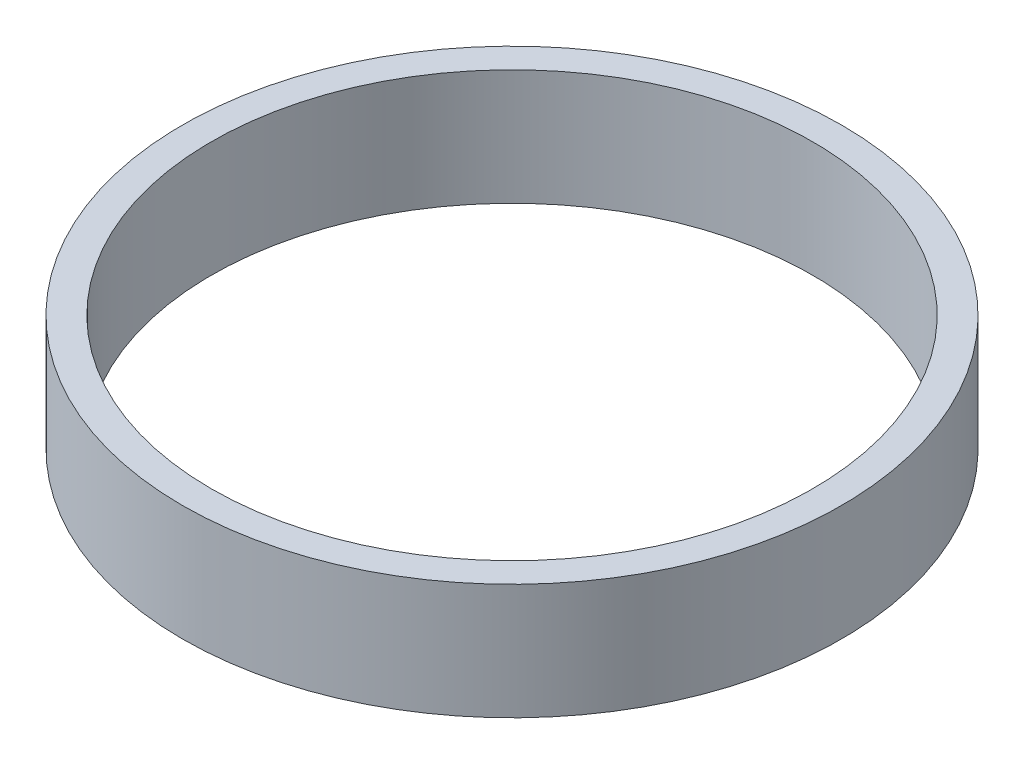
ISO-10303-21;
HEADER;
FILE_DESCRIPTION(('STEP AP214'),'2;1');
FILE_NAME('part.step','',(''),(''),'','','');
FILE_SCHEMA(('AUTOMOTIVE_DESIGN { 1 0 10303 214 1 1 1 1 }'));
ENDSEC;
DATA;
#1=APPLICATION_CONTEXT('core data for automotive mechanical design processes');
#2=APPLICATION_PROTOCOL_DEFINITION('international standard','automotive_design',2000,#1);
#3=PRODUCT_CONTEXT('',#1,'mechanical');
#4=PRODUCT('Part','Part','',(#3));
#5=PRODUCT_RELATED_PRODUCT_CATEGORY('part','',(#4));
#6=PRODUCT_DEFINITION_FORMATION('','',#4);
#7=PRODUCT_DEFINITION_CONTEXT('part definition',#1,'design');
#8=PRODUCT_DEFINITION('design','',#6,#7);
#9=PRODUCT_DEFINITION_SHAPE('','',#8);
#10=(LENGTH_UNIT() NAMED_UNIT(*) SI_UNIT(.MILLI.,.METRE.));
#11=(NAMED_UNIT(*) PLANE_ANGLE_UNIT() SI_UNIT($,.RADIAN.));
#12=(NAMED_UNIT(*) SI_UNIT($,.STERADIAN.) SOLID_ANGLE_UNIT());
#13=UNCERTAINTY_MEASURE_WITH_UNIT(LENGTH_MEASURE(1.E-05),#10,'distance_accuracy_value','');
#14=(GEOMETRIC_REPRESENTATION_CONTEXT(3) GLOBAL_UNCERTAINTY_ASSIGNED_CONTEXT((#13)) GLOBAL_UNIT_ASSIGNED_CONTEXT((#10,
#11,#12)) REPRESENTATION_CONTEXT('',''));
#15=CARTESIAN_POINT('',(0.,0.,0.));
#16=DIRECTION('',(0.,0.,1.));
#17=DIRECTION('',(1.,0.,0.));
#18=AXIS2_PLACEMENT_3D('',#15,#16,#17);
#19=CARTESIAN_POINT('',(0.,12.7,0.));
#20=DIRECTION('',(0.,1.,0.));
#21=DIRECTION('',(0.,0.,1.));
#22=AXIS2_PLACEMENT_3D('',#19,#20,#21);
#23=PLANE('',#22);
#24=CARTESIAN_POINT('',(0.,12.7,0.));
#25=DIRECTION('',(0.,1.,0.));
#26=DIRECTION('',(0.,0.,1.));
#27=AXIS2_PLACEMENT_3D('',#24,#25,#26);
#28=CIRCLE('',#27,72.39);
#29=CARTESIAN_POINT('',(0.,12.7,72.39));
#30=VERTEX_POINT('',#29);
#31=EDGE_CURVE('E10',#30,#30,#28,.T.);
#32=ORIENTED_EDGE('',*,*,#31,.T.);
#33=EDGE_LOOP('',(#32));
#34=FACE_BOUND('',#33,.T.);
#35=CARTESIAN_POINT('',(0.,12.7,0.));
#36=DIRECTION('',(0.,1.,0.));
#37=DIRECTION('',(0.,0.,1.));
#38=AXIS2_PLACEMENT_3D('',#35,#36,#37);
#39=CIRCLE('',#38,66.04);
#40=CARTESIAN_POINT('',(0.,12.7,66.04));
#41=VERTEX_POINT('',#40);
#42=EDGE_CURVE('E59',#41,#41,#39,.T.);
#43=ORIENTED_EDGE('',*,*,#42,.F.);
#44=EDGE_LOOP('',(#43));
#45=FACE_BOUND('',#44,.T.);
#46=ADVANCED_FACE('F44',(#34,#45),#23,.T.);
#47=CARTESIAN_POINT('',(0.,-12.7,0.));
#48=DIRECTION('',(0.,1.,0.));
#49=DIRECTION('',(0.,0.,1.));
#50=AXIS2_PLACEMENT_3D('',#47,#48,#49);
#51=PLANE('',#50);
#52=CARTESIAN_POINT('',(0.,-12.7,0.));
#53=DIRECTION('',(0.,1.,0.));
#54=DIRECTION('',(0.,0.,1.));
#55=AXIS2_PLACEMENT_3D('',#52,#53,#54);
#56=CIRCLE('',#55,72.39);
#57=CARTESIAN_POINT('',(0.,-12.7,72.39));
#58=VERTEX_POINT('',#57);
#59=EDGE_CURVE('E47',#58,#58,#56,.T.);
#60=ORIENTED_EDGE('',*,*,#59,.F.);
#61=EDGE_LOOP('',(#60));
#62=FACE_BOUND('',#61,.T.);
#63=CARTESIAN_POINT('',(0.,-12.7,0.));
#64=DIRECTION('',(0.,1.,0.));
#65=DIRECTION('',(0.,0.,1.));
#66=AXIS2_PLACEMENT_3D('',#63,#64,#65);
#67=CIRCLE('',#66,66.04);
#68=CARTESIAN_POINT('',(0.,-12.7,66.04));
#69=VERTEX_POINT('',#68);
#70=EDGE_CURVE('E58',#69,#69,#67,.T.);
#71=ORIENTED_EDGE('',*,*,#70,.T.);
#72=EDGE_LOOP('',(#71));
#73=FACE_BOUND('',#72,.T.);
#74=ADVANCED_FACE('F75',(#62,#73),#51,.F.);
#75=CARTESIAN_POINT('',(0.,12.7,0.));
#76=DIRECTION('',(0.,-1.,0.));
#77=DIRECTION('',(0.,0.,-1.));
#78=AXIS2_PLACEMENT_3D('',#75,#76,#77);
#79=CYLINDRICAL_SURFACE('',#78,72.39);
#80=ORIENTED_EDGE('',*,*,#31,.F.);
#81=EDGE_LOOP('',(#80));
#82=FACE_BOUND('',#81,.T.);
#83=ORIENTED_EDGE('',*,*,#59,.T.);
#84=EDGE_LOOP('',(#83));
#85=FACE_BOUND('',#84,.T.);
#86=ADVANCED_FACE('F50',(#82,#85),#79,.T.);
#87=CARTESIAN_POINT('',(0.,12.7,0.));
#88=DIRECTION('',(0.,-1.,0.));
#89=DIRECTION('',(0.,0.,-1.));
#90=AXIS2_PLACEMENT_3D('',#87,#88,#89);
#91=CYLINDRICAL_SURFACE('',#90,66.04);
#92=ORIENTED_EDGE('',*,*,#42,.T.);
#93=EDGE_LOOP('',(#92));
#94=FACE_BOUND('',#93,.T.);
#95=ORIENTED_EDGE('',*,*,#70,.F.);
#96=EDGE_LOOP('',(#95));
#97=FACE_BOUND('',#96,.T.);
#98=ADVANCED_FACE('F66',(#94,#97),#91,.F.);
#99=CLOSED_SHELL('',(#46,#74,#86,#98));
#100=MANIFOLD_SOLID_BREP('B2',#99);
#101=ADVANCED_BREP_SHAPE_REPRESENTATION('',(#18,#100),#14);
#102=SHAPE_DEFINITION_REPRESENTATION(#9,#101);
ENDSEC;
END-ISO-10303-21;
